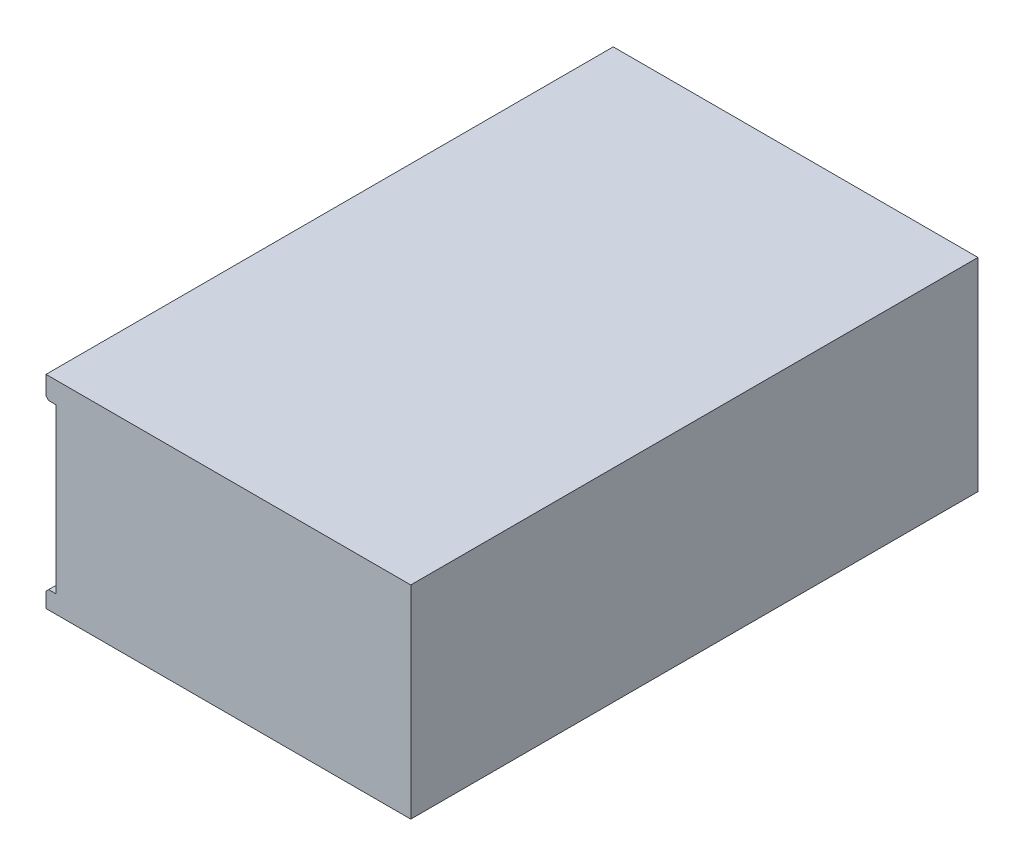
ISO-10303-21;
HEADER;
FILE_DESCRIPTION(('STEP AP214'),'2;1');
FILE_NAME('part.step','',(''),(''),'','','');
FILE_SCHEMA(('AUTOMOTIVE_DESIGN { 1 0 10303 214 1 1 1 1 }'));
ENDSEC;
DATA;
#1=APPLICATION_CONTEXT('core data for automotive mechanical design processes');
#2=APPLICATION_PROTOCOL_DEFINITION('international standard','automotive_design',2000,#1);
#3=PRODUCT_CONTEXT('',#1,'mechanical');
#4=PRODUCT('Part','Part','',(#3));
#5=PRODUCT_RELATED_PRODUCT_CATEGORY('part','',(#4));
#6=PRODUCT_DEFINITION_FORMATION('','',#4);
#7=PRODUCT_DEFINITION_CONTEXT('part definition',#1,'design');
#8=PRODUCT_DEFINITION('design','',#6,#7);
#9=PRODUCT_DEFINITION_SHAPE('','',#8);
#10=(LENGTH_UNIT() NAMED_UNIT(*) SI_UNIT(.MILLI.,.METRE.));
#11=(NAMED_UNIT(*) PLANE_ANGLE_UNIT() SI_UNIT($,.RADIAN.));
#12=(NAMED_UNIT(*) SI_UNIT($,.STERADIAN.) SOLID_ANGLE_UNIT());
#13=UNCERTAINTY_MEASURE_WITH_UNIT(LENGTH_MEASURE(1.E-05),#10,'distance_accuracy_value','');
#14=(GEOMETRIC_REPRESENTATION_CONTEXT(3) GLOBAL_UNCERTAINTY_ASSIGNED_CONTEXT((#13)) GLOBAL_UNIT_ASSIGNED_CONTEXT((#10,
#11,#12)) REPRESENTATION_CONTEXT('',''));
#15=CARTESIAN_POINT('',(0.,0.,0.));
#16=DIRECTION('',(0.,0.,1.));
#17=DIRECTION('',(1.,0.,0.));
#18=AXIS2_PLACEMENT_3D('',#15,#16,#17);
#19=CARTESIAN_POINT('',(-1.397,0.,40.4876));
#20=DIRECTION('',(0.,-1.,0.));
#21=DIRECTION('',(0.,0.,-1.));
#22=AXIS2_PLACEMENT_3D('',#19,#20,#21);
#23=PLANE('',#22);
#24=DIRECTION('',(-1.,0.,0.));
#25=VECTOR('',#24,1.);
#26=CARTESIAN_POINT('',(-1.397,0.,-40.4876));
#27=LINE('',#26,#25);
#28=CARTESIAN_POINT('',(50.673,0.,-40.4876));
#29=VERTEX_POINT('',#28);
#30=CARTESIAN_POINT('',(-1.397,0.,-40.4876));
#31=VERTEX_POINT('',#30);
#32=EDGE_CURVE('E180',#29,#31,#27,.T.);
#33=ORIENTED_EDGE('',*,*,#32,.T.);
#34=DIRECTION('',(0.,0.,-1.));
#35=VECTOR('',#34,1.);
#36=CARTESIAN_POINT('',(-1.397,0.,40.4876));
#37=LINE('',#36,#35);
#38=CARTESIAN_POINT('',(-1.397,0.,40.4876));
#39=VERTEX_POINT('',#38);
#40=EDGE_CURVE('E231',#39,#31,#37,.T.);
#41=ORIENTED_EDGE('',*,*,#40,.F.);
#42=DIRECTION('',(-1.,0.,0.));
#43=VECTOR('',#42,1.);
#44=CARTESIAN_POINT('',(-1.397,0.,40.4876));
#45=LINE('',#44,#43);
#46=CARTESIAN_POINT('',(50.673,0.,40.4876));
#47=VERTEX_POINT('',#46);
#48=EDGE_CURVE('E181',#47,#39,#45,.T.);
#49=ORIENTED_EDGE('',*,*,#48,.F.);
#50=DIRECTION('',(0.,0.,-1.));
#51=VECTOR('',#50,1.);
#52=CARTESIAN_POINT('',(50.673,0.,40.4876));
#53=LINE('',#52,#51);
#54=EDGE_CURVE('E200',#47,#29,#53,.T.);
#55=ORIENTED_EDGE('',*,*,#54,.T.);
#56=EDGE_LOOP('',(#33,#41,#49,#55));
#57=FACE_BOUND('',#56,.T.);
#58=ADVANCED_FACE('F37',(#57),#23,.F.);
#59=CARTESIAN_POINT('',(-1.397,-3.048,40.4876));
#60=DIRECTION('',(1.,0.,0.));
#61=DIRECTION('',(0.,0.,-1.));
#62=AXIS2_PLACEMENT_3D('',#59,#60,#61);
#63=PLANE('',#62);
#64=DIRECTION('',(0.,-1.,0.));
#65=VECTOR('',#64,1.);
#66=CARTESIAN_POINT('',(-1.397,-3.048,-40.4876));
#67=LINE('',#66,#65);
#68=CARTESIAN_POINT('',(-1.397,-2.66700000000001,-40.4876));
#69=VERTEX_POINT('',#68);
#70=EDGE_CURVE('E203',#31,#69,#67,.T.);
#71=ORIENTED_EDGE('',*,*,#70,.T.);
#72=DIRECTION('',(0.,0.,1.));
#73=VECTOR('',#72,1.);
#74=CARTESIAN_POINT('',(-1.397,-2.66700000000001,40.4876));
#75=LINE('',#74,#73);
#76=CARTESIAN_POINT('',(-1.397,-2.66700000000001,40.4876));
#77=VERTEX_POINT('',#76);
#78=EDGE_CURVE('E11',#69,#77,#75,.T.);
#79=ORIENTED_EDGE('',*,*,#78,.T.);
#80=DIRECTION('',(0.,-1.,0.));
#81=VECTOR('',#80,1.);
#82=CARTESIAN_POINT('',(-1.397,-3.048,40.4876));
#83=LINE('',#82,#81);
#84=EDGE_CURVE('E184',#39,#77,#83,.T.);
#85=ORIENTED_EDGE('',*,*,#84,.F.);
#86=ORIENTED_EDGE('',*,*,#40,.T.);
#87=EDGE_LOOP('',(#71,#79,#85,#86));
#88=FACE_BOUND('',#87,.T.);
#89=ADVANCED_FACE('F287',(#88),#63,.F.);
#90=CARTESIAN_POINT('',(0.,-3.048,40.4876));
#91=DIRECTION('',(0.,1.,0.));
#92=DIRECTION('',(0.,0.,1.));
#93=AXIS2_PLACEMENT_3D('',#90,#91,#92);
#94=PLANE('',#93);
#95=DIRECTION('',(1.,0.,0.));
#96=VECTOR('',#95,1.);
#97=CARTESIAN_POINT('',(0.,-3.048,40.4876));
#98=LINE('',#97,#96);
#99=CARTESIAN_POINT('',(-1.016,-3.048,40.4876));
#100=VERTEX_POINT('',#99);
#101=CARTESIAN_POINT('',(0.,-3.048,40.4876));
#102=VERTEX_POINT('',#101);
#103=EDGE_CURVE('E187',#100,#102,#98,.T.);
#104=ORIENTED_EDGE('',*,*,#103,.F.);
#105=DIRECTION('',(0.,0.,-1.));
#106=VECTOR('',#105,1.);
#107=CARTESIAN_POINT('',(-1.016,-3.048,40.4876));
#108=LINE('',#107,#106);
#109=CARTESIAN_POINT('',(-1.016,-3.048,-40.4876));
#110=VERTEX_POINT('',#109);
#111=EDGE_CURVE('E45',#100,#110,#108,.T.);
#112=ORIENTED_EDGE('',*,*,#111,.T.);
#113=DIRECTION('',(1.,0.,0.));
#114=VECTOR('',#113,1.);
#115=CARTESIAN_POINT('',(0.,-3.048,-40.4876));
#116=LINE('',#115,#114);
#117=CARTESIAN_POINT('',(0.,-3.048,-40.4876));
#118=VERTEX_POINT('',#117);
#119=EDGE_CURVE('E205',#110,#118,#116,.T.);
#120=ORIENTED_EDGE('',*,*,#119,.T.);
#121=DIRECTION('',(0.,0.,-1.));
#122=VECTOR('',#121,1.);
#123=CARTESIAN_POINT('',(0.,-3.048,40.4876));
#124=LINE('',#123,#122);
#125=EDGE_CURVE('E228',#102,#118,#124,.T.);
#126=ORIENTED_EDGE('',*,*,#125,.F.);
#127=EDGE_LOOP('',(#104,#112,#120,#126));
#128=FACE_BOUND('',#127,.T.);
#129=ADVANCED_FACE('F249',(#128),#94,.F.);
#130=CARTESIAN_POINT('',(0.,-26.416,40.4876));
#131=DIRECTION('',(1.,0.,0.));
#132=DIRECTION('',(0.,0.,-1.));
#133=AXIS2_PLACEMENT_3D('',#130,#131,#132);
#134=PLANE('',#133);
#135=CARTESIAN_POINT('',(0.,-6.34999999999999,-35.179));
#136=DIRECTION('',(-1.,0.,0.));
#137=DIRECTION('',(0.,0.,1.));
#138=AXIS2_PLACEMENT_3D('',#135,#136,#137);
#139=CIRCLE('',#138,2.413);
#140=CARTESIAN_POINT('',(0.,-6.34999999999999,-32.766));
#141=VERTEX_POINT('',#140);
#142=EDGE_CURVE('E141',#141,#141,#139,.T.);
#143=ORIENTED_EDGE('',*,*,#142,.F.);
#144=EDGE_LOOP('',(#143));
#145=FACE_BOUND('',#144,.T.);
#146=CARTESIAN_POINT('',(0.,-6.34999999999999,35.179));
#147=DIRECTION('',(-1.,0.,0.));
#148=DIRECTION('',(0.,0.,1.));
#149=AXIS2_PLACEMENT_3D('',#146,#147,#148);
#150=CIRCLE('',#149,2.413);
#151=CARTESIAN_POINT('',(0.,-6.34999999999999,37.592));
#152=VERTEX_POINT('',#151);
#153=EDGE_CURVE('E153',#152,#152,#150,.T.);
#154=ORIENTED_EDGE('',*,*,#153,.F.);
#155=EDGE_LOOP('',(#154));
#156=FACE_BOUND('',#155,.T.);
#157=CARTESIAN_POINT('',(0.,-23.114,-35.179));
#158=DIRECTION('',(-1.,0.,0.));
#159=DIRECTION('',(0.,0.,1.));
#160=AXIS2_PLACEMENT_3D('',#157,#158,#159);
#161=CIRCLE('',#160,2.413);
#162=CARTESIAN_POINT('',(0.,-23.114,-32.766));
#163=VERTEX_POINT('',#162);
#164=EDGE_CURVE('E165',#163,#163,#161,.T.);
#165=ORIENTED_EDGE('',*,*,#164,.F.);
#166=EDGE_LOOP('',(#165));
#167=FACE_BOUND('',#166,.T.);
#168=CARTESIAN_POINT('',(0.,-23.114,35.179));
#169=DIRECTION('',(-1.,0.,0.));
#170=DIRECTION('',(0.,0.,1.));
#171=AXIS2_PLACEMENT_3D('',#168,#169,#170);
#172=CIRCLE('',#171,2.413);
#173=CARTESIAN_POINT('',(0.,-23.114,37.592));
#174=VERTEX_POINT('',#173);
#175=EDGE_CURVE('E177',#174,#174,#172,.T.);
#176=ORIENTED_EDGE('',*,*,#175,.F.);
#177=EDGE_LOOP('',(#176));
#178=FACE_BOUND('',#177,.T.);
#179=DIRECTION('',(0.,-1.,0.));
#180=VECTOR('',#179,1.);
#181=CARTESIAN_POINT('',(0.,-26.416,-40.4876));
#182=LINE('',#181,#180);
#183=CARTESIAN_POINT('',(0.,-26.416,-40.4876));
#184=VERTEX_POINT('',#183);
#185=EDGE_CURVE('E207',#118,#184,#182,.T.);
#186=ORIENTED_EDGE('',*,*,#185,.T.);
#187=DIRECTION('',(0.,0.,-1.));
#188=VECTOR('',#187,1.);
#189=CARTESIAN_POINT('',(0.,-26.416,40.4876));
#190=LINE('',#189,#188);
#191=CARTESIAN_POINT('',(0.,-26.416,40.4876));
#192=VERTEX_POINT('',#191);
#193=EDGE_CURVE('E225',#192,#184,#190,.T.);
#194=ORIENTED_EDGE('',*,*,#193,.F.);
#195=DIRECTION('',(0.,-1.,0.));
#196=VECTOR('',#195,1.);
#197=CARTESIAN_POINT('',(0.,-26.416,40.4876));
#198=LINE('',#197,#196);
#199=EDGE_CURVE('E189',#102,#192,#198,.T.);
#200=ORIENTED_EDGE('',*,*,#199,.F.);
#201=ORIENTED_EDGE('',*,*,#125,.T.);
#202=EDGE_LOOP('',(#186,#194,#200,#201));
#203=FACE_BOUND('',#202,.T.);
#204=ADVANCED_FACE('F259',(#145,#156,#167,#178,#203),#134,.F.);
#205=CARTESIAN_POINT('',(-1.397,-26.416,40.4876));
#206=DIRECTION('',(0.,-1.,0.));
#207=DIRECTION('',(0.,0.,-1.));
#208=AXIS2_PLACEMENT_3D('',#205,#206,#207);
#209=PLANE('',#208);
#210=DIRECTION('',(-1.,0.,0.));
#211=VECTOR('',#210,1.);
#212=CARTESIAN_POINT('',(-1.397,-26.416,-40.4876));
#213=LINE('',#212,#211);
#214=CARTESIAN_POINT('',(-1.01599999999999,-26.416,-40.4876));
#215=VERTEX_POINT('',#214);
#216=EDGE_CURVE('E209',#184,#215,#213,.T.);
#217=ORIENTED_EDGE('',*,*,#216,.T.);
#218=DIRECTION('',(0.,0.,1.));
#219=VECTOR('',#218,1.);
#220=CARTESIAN_POINT('',(-1.01599999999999,-26.416,40.4876));
#221=LINE('',#220,#219);
#222=CARTESIAN_POINT('',(-1.01599999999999,-26.416,40.4876));
#223=VERTEX_POINT('',#222);
#224=EDGE_CURVE('E241',#215,#223,#221,.T.);
#225=ORIENTED_EDGE('',*,*,#224,.T.);
#226=DIRECTION('',(-1.,0.,0.));
#227=VECTOR('',#226,1.);
#228=CARTESIAN_POINT('',(-1.397,-26.416,40.4876));
#229=LINE('',#228,#227);
#230=EDGE_CURVE('E191',#192,#223,#229,.T.);
#231=ORIENTED_EDGE('',*,*,#230,.F.);
#232=ORIENTED_EDGE('',*,*,#193,.T.);
#233=EDGE_LOOP('',(#217,#225,#231,#232));
#234=FACE_BOUND('',#233,.T.);
#235=ADVANCED_FACE('F263',(#234),#209,.F.);
#236=CARTESIAN_POINT('',(-1.397,-28.956,40.4876));
#237=DIRECTION('',(1.,0.,0.));
#238=DIRECTION('',(0.,1.,0.));
#239=AXIS2_PLACEMENT_3D('',#236,#237,#238);
#240=PLANE('',#239);
#241=DIRECTION('',(0.,-1.,0.));
#242=VECTOR('',#241,1.);
#243=CARTESIAN_POINT('',(-1.397,-28.956,40.4876));
#244=LINE('',#243,#242);
#245=CARTESIAN_POINT('',(-1.397,-26.797,40.4876));
#246=VERTEX_POINT('',#245);
#247=CARTESIAN_POINT('',(-1.397,-28.956,40.4876));
#248=VERTEX_POINT('',#247);
#249=EDGE_CURVE('E194',#246,#248,#244,.T.);
#250=ORIENTED_EDGE('',*,*,#249,.F.);
#251=DIRECTION('',(0.,0.,-1.));
#252=VECTOR('',#251,1.);
#253=CARTESIAN_POINT('',(-1.397,-26.797,40.4876));
#254=LINE('',#253,#252);
#255=CARTESIAN_POINT('',(-1.397,-26.797,-40.4876));
#256=VERTEX_POINT('',#255);
#257=EDGE_CURVE('E234',#246,#256,#254,.T.);
#258=ORIENTED_EDGE('',*,*,#257,.T.);
#259=DIRECTION('',(0.,-1.,0.));
#260=VECTOR('',#259,1.);
#261=CARTESIAN_POINT('',(-1.397,-28.956,-40.4876));
#262=LINE('',#261,#260);
#263=CARTESIAN_POINT('',(-1.397,-28.956,-40.4876));
#264=VERTEX_POINT('',#263);
#265=EDGE_CURVE('E212',#256,#264,#262,.T.);
#266=ORIENTED_EDGE('',*,*,#265,.T.);
#267=DIRECTION('',(0.,0.,-1.));
#268=VECTOR('',#267,1.);
#269=CARTESIAN_POINT('',(-1.397,-28.956,40.4876));
#270=LINE('',#269,#268);
#271=EDGE_CURVE('E222',#248,#264,#270,.T.);
#272=ORIENTED_EDGE('',*,*,#271,.F.);
#273=EDGE_LOOP('',(#250,#258,#266,#272));
#274=FACE_BOUND('',#273,.T.);
#275=ADVANCED_FACE('F271',(#274),#240,.F.);
#276=CARTESIAN_POINT('',(50.673,-28.956,40.4876));
#277=DIRECTION('',(0.,1.,0.));
#278=DIRECTION('',(-1.,0.,0.));
#279=AXIS2_PLACEMENT_3D('',#276,#277,#278);
#280=PLANE('',#279);
#281=DIRECTION('',(1.,0.,0.));
#282=VECTOR('',#281,1.);
#283=CARTESIAN_POINT('',(50.673,-28.956,-40.4876));
#284=LINE('',#283,#282);
#285=CARTESIAN_POINT('',(50.673,-28.956,-40.4876));
#286=VERTEX_POINT('',#285);
#287=EDGE_CURVE('E214',#264,#286,#284,.T.);
#288=ORIENTED_EDGE('',*,*,#287,.T.);
#289=DIRECTION('',(0.,0.,-1.));
#290=VECTOR('',#289,1.);
#291=CARTESIAN_POINT('',(50.673,-28.956,40.4876));
#292=LINE('',#291,#290);
#293=CARTESIAN_POINT('',(50.673,-28.956,40.4876));
#294=VERTEX_POINT('',#293);
#295=EDGE_CURVE('E219',#294,#286,#292,.T.);
#296=ORIENTED_EDGE('',*,*,#295,.F.);
#297=DIRECTION('',(1.,0.,0.));
#298=VECTOR('',#297,1.);
#299=CARTESIAN_POINT('',(50.673,-28.956,40.4876));
#300=LINE('',#299,#298);
#301=EDGE_CURVE('E196',#248,#294,#300,.T.);
#302=ORIENTED_EDGE('',*,*,#301,.F.);
#303=ORIENTED_EDGE('',*,*,#271,.T.);
#304=EDGE_LOOP('',(#288,#296,#302,#303));
#305=FACE_BOUND('',#304,.T.);
#306=ADVANCED_FACE('F278',(#305),#280,.F.);
#307=CARTESIAN_POINT('',(50.673,0.,40.4876));
#308=DIRECTION('',(-1.,0.,0.));
#309=DIRECTION('',(0.,-1.,0.));
#310=AXIS2_PLACEMENT_3D('',#307,#308,#309);
#311=PLANE('',#310);
#312=DIRECTION('',(0.,1.,0.));
#313=VECTOR('',#312,1.);
#314=CARTESIAN_POINT('',(50.673,0.,-40.4876));
#315=LINE('',#314,#313);
#316=EDGE_CURVE('E185',#286,#29,#315,.T.);
#317=ORIENTED_EDGE('',*,*,#316,.T.);
#318=ORIENTED_EDGE('',*,*,#54,.F.);
#319=DIRECTION('',(0.,1.,0.));
#320=VECTOR('',#319,1.);
#321=CARTESIAN_POINT('',(50.673,0.,40.4876));
#322=LINE('',#321,#320);
#323=EDGE_CURVE('E198',#294,#47,#322,.T.);
#324=ORIENTED_EDGE('',*,*,#323,.F.);
#325=ORIENTED_EDGE('',*,*,#295,.T.);
#326=EDGE_LOOP('',(#317,#318,#324,#325));
#327=FACE_BOUND('',#326,.T.);
#328=ADVANCED_FACE('F282',(#327),#311,.F.);
#329=CARTESIAN_POINT('',(0.,0.,40.4876));
#330=DIRECTION('',(0.,0.,1.));
#331=DIRECTION('',(1.,0.,0.));
#332=AXIS2_PLACEMENT_3D('',#329,#330,#331);
#333=PLANE('',#332);
#334=ORIENTED_EDGE('',*,*,#230,.T.);
#335=DIRECTION('',(0.707106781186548,0.707106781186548,0.));
#336=VECTOR('',#335,1.);
#337=CARTESIAN_POINT('',(12.7,-12.7,40.4876));
#338=LINE('',#337,#336);
#339=EDGE_CURVE('E244',#223,#246,#338,.F.);
#340=ORIENTED_EDGE('',*,*,#339,.T.);
#341=ORIENTED_EDGE('',*,*,#249,.T.);
#342=ORIENTED_EDGE('',*,*,#301,.T.);
#343=ORIENTED_EDGE('',*,*,#323,.T.);
#344=ORIENTED_EDGE('',*,*,#48,.T.);
#345=ORIENTED_EDGE('',*,*,#84,.T.);
#346=DIRECTION('',(-0.707106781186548,0.707106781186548,0.));
#347=VECTOR('',#346,1.);
#348=CARTESIAN_POINT('',(-2.032,-2.032,40.4876));
#349=LINE('',#348,#347);
#350=EDGE_CURVE('E52',#77,#100,#349,.F.);
#351=ORIENTED_EDGE('',*,*,#350,.T.);
#352=ORIENTED_EDGE('',*,*,#103,.T.);
#353=ORIENTED_EDGE('',*,*,#199,.T.);
#354=EDGE_LOOP('',(#334,#340,#341,#342,#343,#344,#345,#351,#352,#353));
#355=FACE_BOUND('',#354,.T.);
#356=ADVANCED_FACE('F266',(#355),#333,.T.);
#357=CARTESIAN_POINT('',(0.,0.,-40.4876));
#358=DIRECTION('',(0.,0.,1.));
#359=DIRECTION('',(1.,0.,0.));
#360=AXIS2_PLACEMENT_3D('',#357,#358,#359);
#361=PLANE('',#360);
#362=ORIENTED_EDGE('',*,*,#265,.F.);
#363=DIRECTION('',(-0.707106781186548,-0.707106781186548,0.));
#364=VECTOR('',#363,1.);
#365=CARTESIAN_POINT('',(-1.397,-26.797,-40.4876));
#366=LINE('',#365,#364);
#367=EDGE_CURVE('E239',#256,#215,#366,.F.);
#368=ORIENTED_EDGE('',*,*,#367,.T.);
#369=ORIENTED_EDGE('',*,*,#216,.F.);
#370=ORIENTED_EDGE('',*,*,#185,.F.);
#371=ORIENTED_EDGE('',*,*,#119,.F.);
#372=DIRECTION('',(0.707106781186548,-0.707106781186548,0.));
#373=VECTOR('',#372,1.);
#374=CARTESIAN_POINT('',(-1.016,-3.048,-40.4876));
#375=LINE('',#374,#373);
#376=EDGE_CURVE('E237',#110,#69,#375,.F.);
#377=ORIENTED_EDGE('',*,*,#376,.T.);
#378=ORIENTED_EDGE('',*,*,#70,.F.);
#379=ORIENTED_EDGE('',*,*,#32,.F.);
#380=ORIENTED_EDGE('',*,*,#316,.F.);
#381=ORIENTED_EDGE('',*,*,#287,.F.);
#382=EDGE_LOOP('',(#362,#368,#369,#370,#371,#377,#378,#379,#380,#381));
#383=FACE_BOUND('',#382,.T.);
#384=ADVANCED_FACE('F255',(#383),#361,.F.);
#385=CARTESIAN_POINT('',(0.,-23.114,35.179));
#386=DIRECTION('',(-1.,0.,0.));
#387=DIRECTION('',(0.,0.,1.));
#388=AXIS2_PLACEMENT_3D('',#385,#386,#387);
#389=CYLINDRICAL_SURFACE('',#388,2.413);
#390=CARTESIAN_POINT('',(7.62,-23.114,35.179));
#391=DIRECTION('',(-1.,0.,0.));
#392=DIRECTION('',(0.,0.,1.));
#393=AXIS2_PLACEMENT_3D('',#390,#391,#392);
#394=CIRCLE('',#393,2.413);
#395=CARTESIAN_POINT('',(7.62,-23.114,37.592));
#396=VERTEX_POINT('',#395);
#397=EDGE_CURVE('E174',#396,#396,#394,.T.);
#398=ORIENTED_EDGE('',*,*,#397,.F.);
#399=EDGE_LOOP('',(#398));
#400=FACE_BOUND('',#399,.T.);
#401=ORIENTED_EDGE('',*,*,#175,.T.);
#402=EDGE_LOOP('',(#401));
#403=FACE_BOUND('',#402,.T.);
#404=ADVANCED_FACE('F314',(#400,#403),#389,.F.);
#405=CARTESIAN_POINT('',(7.62,-21.0947,35.179));
#406=DIRECTION('',(1.,0.,0.));
#407=DIRECTION('',(0.,0.,-1.));
#408=AXIS2_PLACEMENT_3D('',#405,#406,#407);
#409=PLANE('',#408);
#410=CARTESIAN_POINT('',(7.62,-23.114,35.179));
#411=DIRECTION('',(-1.,0.,0.));
#412=DIRECTION('',(0.,0.,1.));
#413=AXIS2_PLACEMENT_3D('',#410,#411,#412);
#414=CIRCLE('',#413,2.0193);
#415=CARTESIAN_POINT('',(7.62,-23.114,37.1983));
#416=VERTEX_POINT('',#415);
#417=EDGE_CURVE('E171',#416,#416,#414,.T.);
#418=ORIENTED_EDGE('',*,*,#417,.F.);
#419=EDGE_LOOP('',(#418));
#420=FACE_BOUND('',#419,.T.);
#421=ORIENTED_EDGE('',*,*,#397,.T.);
#422=EDGE_LOOP('',(#421));
#423=FACE_BOUND('',#422,.T.);
#424=ADVANCED_FACE('F319',(#420,#423),#409,.F.);
#425=CARTESIAN_POINT('',(0.,-23.114,35.179));
#426=DIRECTION('',(-1.,0.,0.));
#427=DIRECTION('',(0.,0.,1.));
#428=AXIS2_PLACEMENT_3D('',#425,#426,#427);
#429=CYLINDRICAL_SURFACE('',#428,2.0193);
#430=CARTESIAN_POINT('',(9.99744,-23.114,35.179));
#431=DIRECTION('',(-1.,0.,0.));
#432=DIRECTION('',(0.,0.,1.));
#433=AXIS2_PLACEMENT_3D('',#430,#431,#432);
#434=CIRCLE('',#433,2.0193);
#435=CARTESIAN_POINT('',(9.99744,-23.114,37.1983));
#436=VERTEX_POINT('',#435);
#437=EDGE_CURVE('E168',#436,#436,#434,.T.);
#438=ORIENTED_EDGE('',*,*,#437,.F.);
#439=EDGE_LOOP('',(#438));
#440=FACE_BOUND('',#439,.T.);
#441=ORIENTED_EDGE('',*,*,#417,.T.);
#442=EDGE_LOOP('',(#441));
#443=FACE_BOUND('',#442,.T.);
#444=ADVANCED_FACE('F323',(#440,#443),#429,.F.);
#445=CARTESIAN_POINT('',(9.99744,-23.114,35.179));
#446=DIRECTION('',(-1.,0.,0.));
#447=DIRECTION('',(0.,0.,1.));
#448=AXIS2_PLACEMENT_3D('',#445,#446,#447);
#449=CONICAL_SURFACE('',#448,2.0193,1.02974425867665);
#450=CARTESIAN_POINT('',(11.2107578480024,-23.114,35.179));
#451=VERTEX_POINT('',#450);
#452=VERTEX_LOOP('',#451);
#453=FACE_BOUND('',#452,.T.);
#454=ORIENTED_EDGE('',*,*,#437,.T.);
#455=EDGE_LOOP('',(#454));
#456=FACE_BOUND('',#455,.T.);
#457=ADVANCED_FACE('F327',(#453,#456),#449,.F.);
#458=CARTESIAN_POINT('',(0.,-23.114,-35.179));
#459=DIRECTION('',(-1.,0.,0.));
#460=DIRECTION('',(0.,0.,1.));
#461=AXIS2_PLACEMENT_3D('',#458,#459,#460);
#462=CYLINDRICAL_SURFACE('',#461,2.413);
#463=CARTESIAN_POINT('',(7.62,-23.114,-35.179));
#464=DIRECTION('',(-1.,0.,0.));
#465=DIRECTION('',(0.,0.,1.));
#466=AXIS2_PLACEMENT_3D('',#463,#464,#465);
#467=CIRCLE('',#466,2.413);
#468=CARTESIAN_POINT('',(7.62,-23.114,-32.766));
#469=VERTEX_POINT('',#468);
#470=EDGE_CURVE('E162',#469,#469,#467,.T.);
#471=ORIENTED_EDGE('',*,*,#470,.F.);
#472=EDGE_LOOP('',(#471));
#473=FACE_BOUND('',#472,.T.);
#474=ORIENTED_EDGE('',*,*,#164,.T.);
#475=EDGE_LOOP('',(#474));
#476=FACE_BOUND('',#475,.T.);
#477=ADVANCED_FACE('F331',(#473,#476),#462,.F.);
#478=CARTESIAN_POINT('',(7.62,-21.0947,-35.179));
#479=DIRECTION('',(1.,0.,0.));
#480=DIRECTION('',(0.,0.,-1.));
#481=AXIS2_PLACEMENT_3D('',#478,#479,#480);
#482=PLANE('',#481);
#483=CARTESIAN_POINT('',(7.62,-23.114,-35.179));
#484=DIRECTION('',(-1.,0.,0.));
#485=DIRECTION('',(0.,0.,1.));
#486=AXIS2_PLACEMENT_3D('',#483,#484,#485);
#487=CIRCLE('',#486,2.0193);
#488=CARTESIAN_POINT('',(7.62,-23.114,-33.1597));
#489=VERTEX_POINT('',#488);
#490=EDGE_CURVE('E159',#489,#489,#487,.T.);
#491=ORIENTED_EDGE('',*,*,#490,.F.);
#492=EDGE_LOOP('',(#491));
#493=FACE_BOUND('',#492,.T.);
#494=ORIENTED_EDGE('',*,*,#470,.T.);
#495=EDGE_LOOP('',(#494));
#496=FACE_BOUND('',#495,.T.);
#497=ADVANCED_FACE('F335',(#493,#496),#482,.F.);
#498=CARTESIAN_POINT('',(0.,-23.114,-35.179));
#499=DIRECTION('',(-1.,0.,0.));
#500=DIRECTION('',(0.,0.,1.));
#501=AXIS2_PLACEMENT_3D('',#498,#499,#500);
#502=CYLINDRICAL_SURFACE('',#501,2.0193);
#503=CARTESIAN_POINT('',(9.99744,-23.114,-35.179));
#504=DIRECTION('',(-1.,0.,0.));
#505=DIRECTION('',(0.,0.,1.));
#506=AXIS2_PLACEMENT_3D('',#503,#504,#505);
#507=CIRCLE('',#506,2.0193);
#508=CARTESIAN_POINT('',(9.99744,-23.114,-33.1597));
#509=VERTEX_POINT('',#508);
#510=EDGE_CURVE('E156',#509,#509,#507,.T.);
#511=ORIENTED_EDGE('',*,*,#510,.F.);
#512=EDGE_LOOP('',(#511));
#513=FACE_BOUND('',#512,.T.);
#514=ORIENTED_EDGE('',*,*,#490,.T.);
#515=EDGE_LOOP('',(#514));
#516=FACE_BOUND('',#515,.T.);
#517=ADVANCED_FACE('F339',(#513,#516),#502,.F.);
#518=CARTESIAN_POINT('',(9.99744,-23.114,-35.179));
#519=DIRECTION('',(-1.,0.,0.));
#520=DIRECTION('',(0.,0.,1.));
#521=AXIS2_PLACEMENT_3D('',#518,#519,#520);
#522=CONICAL_SURFACE('',#521,2.0193,1.02974425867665);
#523=CARTESIAN_POINT('',(11.2107578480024,-23.114,-35.179));
#524=VERTEX_POINT('',#523);
#525=VERTEX_LOOP('',#524);
#526=FACE_BOUND('',#525,.T.);
#527=ORIENTED_EDGE('',*,*,#510,.T.);
#528=EDGE_LOOP('',(#527));
#529=FACE_BOUND('',#528,.T.);
#530=ADVANCED_FACE('F343',(#526,#529),#522,.F.);
#531=CARTESIAN_POINT('',(0.,-6.34999999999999,35.179));
#532=DIRECTION('',(-1.,0.,0.));
#533=DIRECTION('',(0.,0.,1.));
#534=AXIS2_PLACEMENT_3D('',#531,#532,#533);
#535=CYLINDRICAL_SURFACE('',#534,2.413);
#536=CARTESIAN_POINT('',(7.62,-6.34999999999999,35.179));
#537=DIRECTION('',(-1.,0.,0.));
#538=DIRECTION('',(0.,0.,1.));
#539=AXIS2_PLACEMENT_3D('',#536,#537,#538);
#540=CIRCLE('',#539,2.413);
#541=CARTESIAN_POINT('',(7.62,-6.34999999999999,37.592));
#542=VERTEX_POINT('',#541);
#543=EDGE_CURVE('E150',#542,#542,#540,.T.);
#544=ORIENTED_EDGE('',*,*,#543,.F.);
#545=EDGE_LOOP('',(#544));
#546=FACE_BOUND('',#545,.T.);
#547=ORIENTED_EDGE('',*,*,#153,.T.);
#548=EDGE_LOOP('',(#547));
#549=FACE_BOUND('',#548,.T.);
#550=ADVANCED_FACE('F347',(#546,#549),#535,.F.);
#551=CARTESIAN_POINT('',(7.62,-4.3307,35.179));
#552=DIRECTION('',(1.,0.,0.));
#553=DIRECTION('',(0.,0.,-1.));
#554=AXIS2_PLACEMENT_3D('',#551,#552,#553);
#555=PLANE('',#554);
#556=CARTESIAN_POINT('',(7.62,-6.34999999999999,35.179));
#557=DIRECTION('',(-1.,0.,0.));
#558=DIRECTION('',(0.,0.,1.));
#559=AXIS2_PLACEMENT_3D('',#556,#557,#558);
#560=CIRCLE('',#559,2.0193);
#561=CARTESIAN_POINT('',(7.62,-6.34999999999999,37.1983));
#562=VERTEX_POINT('',#561);
#563=EDGE_CURVE('E147',#562,#562,#560,.T.);
#564=ORIENTED_EDGE('',*,*,#563,.F.);
#565=EDGE_LOOP('',(#564));
#566=FACE_BOUND('',#565,.T.);
#567=ORIENTED_EDGE('',*,*,#543,.T.);
#568=EDGE_LOOP('',(#567));
#569=FACE_BOUND('',#568,.T.);
#570=ADVANCED_FACE('F351',(#566,#569),#555,.F.);
#571=CARTESIAN_POINT('',(0.,-6.34999999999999,35.179));
#572=DIRECTION('',(-1.,0.,0.));
#573=DIRECTION('',(0.,0.,1.));
#574=AXIS2_PLACEMENT_3D('',#571,#572,#573);
#575=CYLINDRICAL_SURFACE('',#574,2.0193);
#576=CARTESIAN_POINT('',(9.99744,-6.34999999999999,35.179));
#577=DIRECTION('',(-1.,0.,0.));
#578=DIRECTION('',(0.,0.,1.));
#579=AXIS2_PLACEMENT_3D('',#576,#577,#578);
#580=CIRCLE('',#579,2.0193);
#581=CARTESIAN_POINT('',(9.99744,-6.34999999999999,37.1983));
#582=VERTEX_POINT('',#581);
#583=EDGE_CURVE('E144',#582,#582,#580,.T.);
#584=ORIENTED_EDGE('',*,*,#583,.F.);
#585=EDGE_LOOP('',(#584));
#586=FACE_BOUND('',#585,.T.);
#587=ORIENTED_EDGE('',*,*,#563,.T.);
#588=EDGE_LOOP('',(#587));
#589=FACE_BOUND('',#588,.T.);
#590=ADVANCED_FACE('F355',(#586,#589),#575,.F.);
#591=CARTESIAN_POINT('',(9.99744,-6.34999999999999,35.179));
#592=DIRECTION('',(-1.,0.,0.));
#593=DIRECTION('',(0.,0.,1.));
#594=AXIS2_PLACEMENT_3D('',#591,#592,#593);
#595=CONICAL_SURFACE('',#594,2.0193,1.02974425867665);
#596=CARTESIAN_POINT('',(11.2107578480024,-6.35,35.179));
#597=VERTEX_POINT('',#596);
#598=VERTEX_LOOP('',#597);
#599=FACE_BOUND('',#598,.T.);
#600=ORIENTED_EDGE('',*,*,#583,.T.);
#601=EDGE_LOOP('',(#600));
#602=FACE_BOUND('',#601,.T.);
#603=ADVANCED_FACE('F359',(#599,#602),#595,.F.);
#604=CARTESIAN_POINT('',(0.,-6.34999999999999,-35.179));
#605=DIRECTION('',(-1.,0.,0.));
#606=DIRECTION('',(0.,0.,1.));
#607=AXIS2_PLACEMENT_3D('',#604,#605,#606);
#608=CYLINDRICAL_SURFACE('',#607,2.413);
#609=CARTESIAN_POINT('',(7.62,-6.34999999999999,-35.179));
#610=DIRECTION('',(-1.,0.,0.));
#611=DIRECTION('',(0.,0.,1.));
#612=AXIS2_PLACEMENT_3D('',#609,#610,#611);
#613=CIRCLE('',#612,2.413);
#614=CARTESIAN_POINT('',(7.62,-6.34999999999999,-32.766));
#615=VERTEX_POINT('',#614);
#616=EDGE_CURVE('E136',#615,#615,#613,.T.);
#617=ORIENTED_EDGE('',*,*,#616,.F.);
#618=EDGE_LOOP('',(#617));
#619=FACE_BOUND('',#618,.T.);
#620=ORIENTED_EDGE('',*,*,#142,.T.);
#621=EDGE_LOOP('',(#620));
#622=FACE_BOUND('',#621,.T.);
#623=ADVANCED_FACE('F363',(#619,#622),#608,.F.);
#624=CARTESIAN_POINT('',(7.62,-4.3307,-35.179));
#625=DIRECTION('',(1.,0.,0.));
#626=DIRECTION('',(0.,0.,-1.));
#627=AXIS2_PLACEMENT_3D('',#624,#625,#626);
#628=PLANE('',#627);
#629=CARTESIAN_POINT('',(7.62,-6.34999999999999,-35.179));
#630=DIRECTION('',(-1.,0.,0.));
#631=DIRECTION('',(0.,0.,1.));
#632=AXIS2_PLACEMENT_3D('',#629,#630,#631);
#633=CIRCLE('',#632,2.0193);
#634=CARTESIAN_POINT('',(7.62,-6.34999999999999,-33.1597));
#635=VERTEX_POINT('',#634);
#636=EDGE_CURVE('E133',#635,#635,#633,.T.);
#637=ORIENTED_EDGE('',*,*,#636,.F.);
#638=EDGE_LOOP('',(#637));
#639=FACE_BOUND('',#638,.T.);
#640=ORIENTED_EDGE('',*,*,#616,.T.);
#641=EDGE_LOOP('',(#640));
#642=FACE_BOUND('',#641,.T.);
#643=ADVANCED_FACE('F367',(#639,#642),#628,.F.);
#644=CARTESIAN_POINT('',(0.,-6.34999999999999,-35.179));
#645=DIRECTION('',(-1.,0.,0.));
#646=DIRECTION('',(0.,0.,1.));
#647=AXIS2_PLACEMENT_3D('',#644,#645,#646);
#648=CYLINDRICAL_SURFACE('',#647,2.0193);
#649=CARTESIAN_POINT('',(9.99744,-6.34999999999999,-35.179));
#650=DIRECTION('',(-1.,0.,0.));
#651=DIRECTION('',(0.,0.,1.));
#652=AXIS2_PLACEMENT_3D('',#649,#650,#651);
#653=CIRCLE('',#652,2.0193);
#654=CARTESIAN_POINT('',(9.99744,-6.34999999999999,-33.1597));
#655=VERTEX_POINT('',#654);
#656=EDGE_CURVE('E131',#655,#655,#653,.T.);
#657=ORIENTED_EDGE('',*,*,#656,.F.);
#658=EDGE_LOOP('',(#657));
#659=FACE_BOUND('',#658,.T.);
#660=ORIENTED_EDGE('',*,*,#636,.T.);
#661=EDGE_LOOP('',(#660));
#662=FACE_BOUND('',#661,.T.);
#663=ADVANCED_FACE('F127',(#659,#662),#648,.F.);
#664=CARTESIAN_POINT('',(9.99744,-6.34999999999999,-35.179));
#665=DIRECTION('',(-1.,0.,0.));
#666=DIRECTION('',(0.,0.,1.));
#667=AXIS2_PLACEMENT_3D('',#664,#665,#666);
#668=CONICAL_SURFACE('',#667,2.0193,1.02974425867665);
#669=CARTESIAN_POINT('',(11.2107578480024,-6.35,-35.179));
#670=VERTEX_POINT('',#669);
#671=VERTEX_LOOP('',#670);
#672=FACE_BOUND('',#671,.T.);
#673=ORIENTED_EDGE('',*,*,#656,.T.);
#674=EDGE_LOOP('',(#673));
#675=FACE_BOUND('',#674,.T.);
#676=ADVANCED_FACE('F123',(#672,#675),#668,.F.);
#677=CARTESIAN_POINT('',(-1.397,-26.797,40.4876));
#678=DIRECTION('',(0.707106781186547,-0.707106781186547,0.));
#679=DIRECTION('',(0.707106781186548,0.707106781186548,0.));
#680=AXIS2_PLACEMENT_3D('',#677,#678,#679);
#681=PLANE('',#680);
#682=ORIENTED_EDGE('',*,*,#339,.F.);
#683=ORIENTED_EDGE('',*,*,#224,.F.);
#684=ORIENTED_EDGE('',*,*,#367,.F.);
#685=ORIENTED_EDGE('',*,*,#257,.F.);
#686=EDGE_LOOP('',(#682,#683,#684,#685));
#687=FACE_BOUND('',#686,.T.);
#688=ADVANCED_FACE('F126',(#687),#681,.F.);
#689=CARTESIAN_POINT('',(-1.016,-3.048,40.4876));
#690=DIRECTION('',(0.707106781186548,0.707106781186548,0.));
#691=DIRECTION('',(-0.707106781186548,0.707106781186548,0.));
#692=AXIS2_PLACEMENT_3D('',#689,#690,#691);
#693=PLANE('',#692);
#694=ORIENTED_EDGE('',*,*,#350,.F.);
#695=ORIENTED_EDGE('',*,*,#78,.F.);
#696=ORIENTED_EDGE('',*,*,#376,.F.);
#697=ORIENTED_EDGE('',*,*,#111,.F.);
#698=EDGE_LOOP('',(#694,#695,#696,#697));
#699=FACE_BOUND('',#698,.T.);
#700=ADVANCED_FACE('F39',(#699),#693,.F.);
#701=CLOSED_SHELL('',(#58,#89,#129,#204,#235,#275,#306,#328,#356,#384,#404,#424,#444,#457,#477,
#497,#517,#530,#550,#570,#590,#603,#623,#643,#663,#676,#688,#700));
#702=MANIFOLD_SOLID_BREP('B2',#701);
#703=ADVANCED_BREP_SHAPE_REPRESENTATION('',(#18,#702),#14);
#704=SHAPE_DEFINITION_REPRESENTATION(#9,#703);
ENDSEC;
END-ISO-10303-21;
